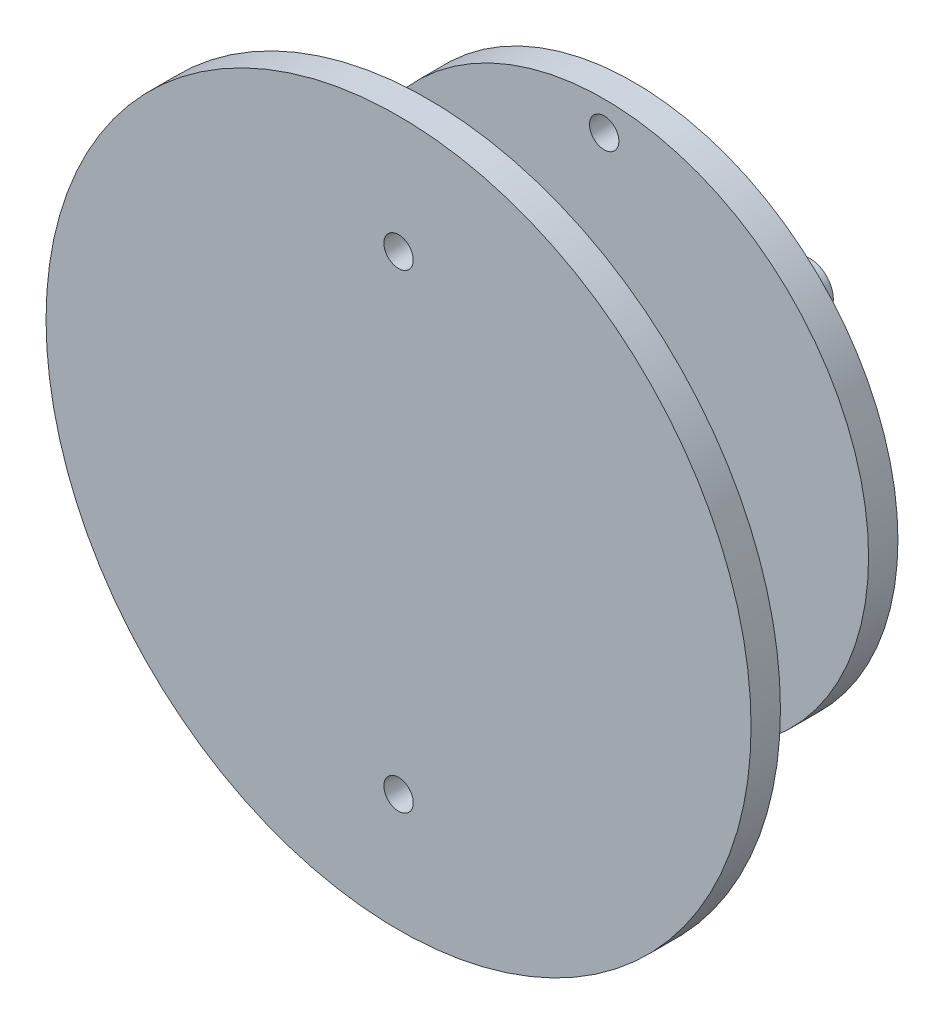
ISO-10303-21;
HEADER;
FILE_DESCRIPTION(('STEP AP214'),'2;1');
FILE_NAME('part.step','',(''),(''),'','','');
FILE_SCHEMA(('AUTOMOTIVE_DESIGN { 1 0 10303 214 1 1 1 1 }'));
ENDSEC;
DATA;
#1=APPLICATION_CONTEXT('core data for automotive mechanical design processes');
#2=APPLICATION_PROTOCOL_DEFINITION('international standard','automotive_design',2000,#1);
#3=PRODUCT_CONTEXT('',#1,'mechanical');
#4=PRODUCT('Part','Part','',(#3));
#5=PRODUCT_RELATED_PRODUCT_CATEGORY('part','',(#4));
#6=PRODUCT_DEFINITION_FORMATION('','',#4);
#7=PRODUCT_DEFINITION_CONTEXT('part definition',#1,'design');
#8=PRODUCT_DEFINITION('design','',#6,#7);
#9=PRODUCT_DEFINITION_SHAPE('','',#8);
#10=(LENGTH_UNIT() NAMED_UNIT(*) SI_UNIT(.MILLI.,.METRE.));
#11=(NAMED_UNIT(*) PLANE_ANGLE_UNIT() SI_UNIT($,.RADIAN.));
#12=(NAMED_UNIT(*) SI_UNIT($,.STERADIAN.) SOLID_ANGLE_UNIT());
#13=UNCERTAINTY_MEASURE_WITH_UNIT(LENGTH_MEASURE(1.E-05),#10,'distance_accuracy_value','');
#14=(GEOMETRIC_REPRESENTATION_CONTEXT(3) GLOBAL_UNCERTAINTY_ASSIGNED_CONTEXT((#13)) GLOBAL_UNIT_ASSIGNED_CONTEXT((#10,
#11,#12)) REPRESENTATION_CONTEXT('',''));
#15=CARTESIAN_POINT('',(0.,0.,0.));
#16=DIRECTION('',(0.,0.,1.));
#17=DIRECTION('',(1.,0.,0.));
#18=AXIS2_PLACEMENT_3D('',#15,#16,#17);
#19=CARTESIAN_POINT('',(0.,0.,70.));
#20=DIRECTION('',(0.,0.,-1.));
#21=DIRECTION('',(-1.,0.,0.));
#22=AXIS2_PLACEMENT_3D('',#19,#20,#21);
#23=CYLINDRICAL_SURFACE('',#22,4.);
#24=CARTESIAN_POINT('',(0.,0.,65.));
#25=DIRECTION('',(0.,0.,1.));
#26=DIRECTION('',(1.,0.,0.));
#27=AXIS2_PLACEMENT_3D('',#24,#25,#26);
#28=CIRCLE('',#27,4.);
#29=CARTESIAN_POINT('',(3.99999999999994,0.,65.));
#30=VERTEX_POINT('',#29);
#31=EDGE_CURVE('E40',#30,#30,#28,.T.);
#32=ORIENTED_EDGE('',*,*,#31,.F.);
#33=EDGE_LOOP('',(#32));
#34=FACE_BOUND('',#33,.T.);
#35=CARTESIAN_POINT('',(0.,0.,35.));
#36=DIRECTION('',(0.,0.,-1.));
#37=DIRECTION('',(-1.,0.,0.));
#38=AXIS2_PLACEMENT_3D('',#35,#36,#37);
#39=CIRCLE('',#38,4.);
#40=CARTESIAN_POINT('',(-4.00000000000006,0.,35.));
#41=VERTEX_POINT('',#40);
#42=EDGE_CURVE('E10',#41,#41,#39,.T.);
#43=ORIENTED_EDGE('',*,*,#42,.F.);
#44=EDGE_LOOP('',(#43));
#45=FACE_BOUND('',#44,.T.);
#46=ADVANCED_FACE('F33',(#34,#45),#23,.T.);
#47=CARTESIAN_POINT('',(0.,0.,65.));
#48=DIRECTION('',(0.,0.,1.));
#49=DIRECTION('',(1.,0.,0.));
#50=AXIS2_PLACEMENT_3D('',#47,#48,#49);
#51=CYLINDRICAL_SURFACE('',#50,60.);
#52=CARTESIAN_POINT('',(0.,0.,65.));
#53=DIRECTION('',(0.,0.,1.));
#54=DIRECTION('',(1.,0.,0.));
#55=AXIS2_PLACEMENT_3D('',#52,#53,#54);
#56=CIRCLE('',#55,60.);
#57=CARTESIAN_POINT('',(59.9999999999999,0.,65.));
#58=VERTEX_POINT('',#57);
#59=EDGE_CURVE('E49',#58,#58,#56,.T.);
#60=ORIENTED_EDGE('',*,*,#59,.T.);
#61=EDGE_LOOP('',(#60));
#62=FACE_BOUND('',#61,.T.);
#63=CARTESIAN_POINT('',(0.,0.,70.));
#64=DIRECTION('',(0.,0.,1.));
#65=DIRECTION('',(1.,0.,0.));
#66=AXIS2_PLACEMENT_3D('',#63,#64,#65);
#67=CIRCLE('',#66,60.);
#68=CARTESIAN_POINT('',(59.9999999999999,0.,70.));
#69=VERTEX_POINT('',#68);
#70=EDGE_CURVE('E54',#69,#69,#67,.T.);
#71=ORIENTED_EDGE('',*,*,#70,.F.);
#72=EDGE_LOOP('',(#71));
#73=FACE_BOUND('',#72,.T.);
#74=ADVANCED_FACE('F73',(#62,#73),#51,.T.);
#75=CARTESIAN_POINT('',(0.,0.,65.));
#76=DIRECTION('',(0.,0.,1.));
#77=DIRECTION('',(1.,0.,0.));
#78=AXIS2_PLACEMENT_3D('',#75,#76,#77);
#79=PLANE('',#78);
#80=CARTESIAN_POINT('',(0.,-40.,65.));
#81=DIRECTION('',(0.,0.,1.));
#82=DIRECTION('',(1.,0.,0.));
#83=AXIS2_PLACEMENT_3D('',#80,#81,#82);
#84=CIRCLE('',#83,2.5);
#85=CARTESIAN_POINT('',(2.5,-40.,65.));
#86=VERTEX_POINT('',#85);
#87=EDGE_CURVE('E186',#86,#86,#84,.F.);
#88=ORIENTED_EDGE('',*,*,#87,.F.);
#89=EDGE_LOOP('',(#88));
#90=FACE_BOUND('',#89,.T.);
#91=CARTESIAN_POINT('',(0.,40.,65.));
#92=DIRECTION('',(0.,0.,1.));
#93=DIRECTION('',(1.,0.,0.));
#94=AXIS2_PLACEMENT_3D('',#91,#92,#93);
#95=CIRCLE('',#94,2.5);
#96=CARTESIAN_POINT('',(2.5,40.,65.));
#97=VERTEX_POINT('',#96);
#98=EDGE_CURVE('E65',#97,#97,#95,.T.);
#99=ORIENTED_EDGE('',*,*,#98,.T.);
#100=EDGE_LOOP('',(#99));
#101=FACE_BOUND('',#100,.T.);
#102=ORIENTED_EDGE('',*,*,#31,.T.);
#103=EDGE_LOOP('',(#102));
#104=FACE_BOUND('',#103,.T.);
#105=ORIENTED_EDGE('',*,*,#59,.F.);
#106=EDGE_LOOP('',(#105));
#107=FACE_BOUND('',#106,.T.);
#108=ADVANCED_FACE('F76',(#90,#101,#104,#107),#79,.F.);
#109=CARTESIAN_POINT('',(0.,0.,70.));
#110=DIRECTION('',(0.,0.,1.));
#111=DIRECTION('',(1.,0.,0.));
#112=AXIS2_PLACEMENT_3D('',#109,#110,#111);
#113=PLANE('',#112);
#114=CARTESIAN_POINT('',(0.,-40.,70.));
#115=DIRECTION('',(0.,0.,1.));
#116=DIRECTION('',(1.,0.,0.));
#117=AXIS2_PLACEMENT_3D('',#114,#115,#116);
#118=CIRCLE('',#117,2.5);
#119=CARTESIAN_POINT('',(2.5,-40.,70.));
#120=VERTEX_POINT('',#119);
#121=EDGE_CURVE('E189',#120,#120,#118,.F.);
#122=ORIENTED_EDGE('',*,*,#121,.T.);
#123=EDGE_LOOP('',(#122));
#124=FACE_BOUND('',#123,.T.);
#125=CARTESIAN_POINT('',(0.,40.,70.));
#126=DIRECTION('',(0.,0.,1.));
#127=DIRECTION('',(1.,0.,0.));
#128=AXIS2_PLACEMENT_3D('',#125,#126,#127);
#129=CIRCLE('',#128,2.5);
#130=CARTESIAN_POINT('',(2.5,40.,70.));
#131=VERTEX_POINT('',#130);
#132=EDGE_CURVE('E176',#131,#131,#129,.T.);
#133=ORIENTED_EDGE('',*,*,#132,.F.);
#134=EDGE_LOOP('',(#133));
#135=FACE_BOUND('',#134,.T.);
#136=ORIENTED_EDGE('',*,*,#70,.T.);
#137=EDGE_LOOP('',(#136));
#138=FACE_BOUND('',#137,.T.);
#139=ADVANCED_FACE('F78',(#124,#135,#138),#113,.T.);
#140=CARTESIAN_POINT('',(0.,0.,35.));
#141=DIRECTION('',(0.,0.,-1.));
#142=DIRECTION('',(-1.,0.,0.));
#143=AXIS2_PLACEMENT_3D('',#140,#141,#142);
#144=CYLINDRICAL_SURFACE('',#143,45.);
#145=CARTESIAN_POINT('',(0.,0.,35.));
#146=DIRECTION('',(0.,0.,-1.));
#147=DIRECTION('',(-1.,0.,0.));
#148=AXIS2_PLACEMENT_3D('',#145,#146,#147);
#149=CIRCLE('',#148,45.);
#150=CARTESIAN_POINT('',(-45.,0.,35.));
#151=VERTEX_POINT('',#150);
#152=EDGE_CURVE('E55',#151,#151,#149,.T.);
#153=ORIENTED_EDGE('',*,*,#152,.T.);
#154=EDGE_LOOP('',(#153));
#155=FACE_BOUND('',#154,.T.);
#156=CARTESIAN_POINT('',(0.,0.,30.));
#157=DIRECTION('',(0.,0.,-1.));
#158=DIRECTION('',(-1.,0.,0.));
#159=AXIS2_PLACEMENT_3D('',#156,#157,#158);
#160=CIRCLE('',#159,45.);
#161=CARTESIAN_POINT('',(-45.,0.,30.));
#162=VERTEX_POINT('',#161);
#163=EDGE_CURVE('E60',#162,#162,#160,.T.);
#164=ORIENTED_EDGE('',*,*,#163,.F.);
#165=EDGE_LOOP('',(#164));
#166=FACE_BOUND('',#165,.T.);
#167=ADVANCED_FACE('F85',(#155,#166),#144,.T.);
#168=CARTESIAN_POINT('',(0.,0.,35.));
#169=DIRECTION('',(0.,0.,-1.));
#170=DIRECTION('',(-1.,0.,0.));
#171=AXIS2_PLACEMENT_3D('',#168,#169,#170);
#172=PLANE('',#171);
#173=CARTESIAN_POINT('',(0.,-40.,35.));
#174=DIRECTION('',(0.,0.,-1.));
#175=DIRECTION('',(-1.,0.,0.));
#176=AXIS2_PLACEMENT_3D('',#173,#174,#175);
#177=CIRCLE('',#176,2.5);
#178=CARTESIAN_POINT('',(-2.5,-40.,35.));
#179=VERTEX_POINT('',#178);
#180=EDGE_CURVE('E192',#179,#179,#177,.F.);
#181=ORIENTED_EDGE('',*,*,#180,.F.);
#182=EDGE_LOOP('',(#181));
#183=FACE_BOUND('',#182,.T.);
#184=CARTESIAN_POINT('',(0.,40.,35.));
#185=DIRECTION('',(0.,0.,-1.));
#186=DIRECTION('',(-1.,0.,0.));
#187=AXIS2_PLACEMENT_3D('',#184,#185,#186);
#188=CIRCLE('',#187,2.5);
#189=CARTESIAN_POINT('',(-2.5,40.,35.));
#190=VERTEX_POINT('',#189);
#191=EDGE_CURVE('E179',#190,#190,#188,.T.);
#192=ORIENTED_EDGE('',*,*,#191,.T.);
#193=EDGE_LOOP('',(#192));
#194=FACE_BOUND('',#193,.T.);
#195=ORIENTED_EDGE('',*,*,#42,.T.);
#196=EDGE_LOOP('',(#195));
#197=FACE_BOUND('',#196,.T.);
#198=ORIENTED_EDGE('',*,*,#152,.F.);
#199=EDGE_LOOP('',(#198));
#200=FACE_BOUND('',#199,.T.);
#201=ADVANCED_FACE('F114',(#183,#194,#197,#200),#172,.F.);
#202=CARTESIAN_POINT('',(0.,0.,30.));
#203=DIRECTION('',(0.,0.,-1.));
#204=DIRECTION('',(-1.,0.,0.));
#205=AXIS2_PLACEMENT_3D('',#202,#203,#204);
#206=PLANE('',#205);
#207=CARTESIAN_POINT('',(0.,-40.,30.));
#208=DIRECTION('',(0.,0.,1.));
#209=DIRECTION('',(-1.,0.,0.));
#210=AXIS2_PLACEMENT_3D('',#207,#208,#209);
#211=CIRCLE('',#210,2.5);
#212=CARTESIAN_POINT('',(-2.5,-40.,30.));
#213=VERTEX_POINT('',#212);
#214=EDGE_CURVE('E195',#213,#213,#211,.T.);
#215=ORIENTED_EDGE('',*,*,#214,.T.);
#216=EDGE_LOOP('',(#215));
#217=FACE_BOUND('',#216,.T.);
#218=CARTESIAN_POINT('',(0.,40.,30.));
#219=DIRECTION('',(0.,0.,-1.));
#220=DIRECTION('',(-1.,0.,0.));
#221=AXIS2_PLACEMENT_3D('',#218,#219,#220);
#222=CIRCLE('',#221,2.5);
#223=CARTESIAN_POINT('',(-2.5,40.,30.));
#224=VERTEX_POINT('',#223);
#225=EDGE_CURVE('E181',#224,#224,#222,.T.);
#226=ORIENTED_EDGE('',*,*,#225,.F.);
#227=EDGE_LOOP('',(#226));
#228=FACE_BOUND('',#227,.T.);
#229=CARTESIAN_POINT('',(0.,0.,30.));
#230=DIRECTION('',(0.,0.,-1.));
#231=DIRECTION('',(-1.,0.,0.));
#232=AXIS2_PLACEMENT_3D('',#229,#230,#231);
#233=CIRCLE('',#232,4.);
#234=CARTESIAN_POINT('',(-4.00000000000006,0.,30.));
#235=VERTEX_POINT('',#234);
#236=EDGE_CURVE('E52',#235,#235,#233,.T.);
#237=ORIENTED_EDGE('',*,*,#236,.F.);
#238=EDGE_LOOP('',(#237));
#239=FACE_BOUND('',#238,.T.);
#240=ORIENTED_EDGE('',*,*,#163,.T.);
#241=EDGE_LOOP('',(#240));
#242=FACE_BOUND('',#241,.T.);
#243=ADVANCED_FACE('F107',(#217,#228,#239,#242),#206,.T.);
#244=CARTESIAN_POINT('',(0.,0.,0.));
#245=DIRECTION('',(0.,0.,1.));
#246=DIRECTION('',(1.,0.,0.));
#247=AXIS2_PLACEMENT_3D('',#244,#245,#246);
#248=PLANE('',#247);
#249=CARTESIAN_POINT('',(0.,0.,0.));
#250=DIRECTION('',(0.,0.,1.));
#251=DIRECTION('',(1.,0.,0.));
#252=AXIS2_PLACEMENT_3D('',#249,#250,#251);
#253=CIRCLE('',#252,4.);
#254=CARTESIAN_POINT('',(3.99999999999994,0.,0.));
#255=VERTEX_POINT('',#254);
#256=EDGE_CURVE('E44',#255,#255,#253,.T.);
#257=ORIENTED_EDGE('',*,*,#256,.F.);
#258=EDGE_LOOP('',(#257));
#259=FACE_BOUND('',#258,.T.);
#260=ADVANCED_FACE('F99',(#259),#248,.F.);
#261=ORIENTED_EDGE('',*,*,#236,.T.);
#262=EDGE_LOOP('',(#261));
#263=FACE_BOUND('',#262,.T.);
#264=ORIENTED_EDGE('',*,*,#256,.T.);
#265=EDGE_LOOP('',(#264));
#266=FACE_BOUND('',#265,.T.);
#267=ADVANCED_FACE('F35',(#263,#266),#23,.T.);
#268=CARTESIAN_POINT('',(0.,40.,130.));
#269=DIRECTION('',(0.,0.,-1.));
#270=DIRECTION('',(-1.,0.,0.));
#271=AXIS2_PLACEMENT_3D('',#268,#269,#270);
#272=CYLINDRICAL_SURFACE('',#271,2.5);
#273=ORIENTED_EDGE('',*,*,#225,.T.);
#274=EDGE_LOOP('',(#273));
#275=FACE_BOUND('',#274,.T.);
#276=ORIENTED_EDGE('',*,*,#191,.F.);
#277=EDGE_LOOP('',(#276));
#278=FACE_BOUND('',#277,.T.);
#279=ADVANCED_FACE('F98',(#275,#278),#272,.F.);
#280=ORIENTED_EDGE('',*,*,#132,.T.);
#281=EDGE_LOOP('',(#280));
#282=FACE_BOUND('',#281,.T.);
#283=ORIENTED_EDGE('',*,*,#98,.F.);
#284=EDGE_LOOP('',(#283));
#285=FACE_BOUND('',#284,.T.);
#286=ADVANCED_FACE('F104',(#282,#285),#272,.F.);
#287=CARTESIAN_POINT('',(0.,-40.,130.));
#288=DIRECTION('',(0.,0.,-1.));
#289=DIRECTION('',(-1.,0.,0.));
#290=AXIS2_PLACEMENT_3D('',#287,#288,#289);
#291=CYLINDRICAL_SURFACE('',#290,2.5);
#292=ORIENTED_EDGE('',*,*,#214,.F.);
#293=EDGE_LOOP('',(#292));
#294=FACE_BOUND('',#293,.T.);
#295=ORIENTED_EDGE('',*,*,#180,.T.);
#296=EDGE_LOOP('',(#295));
#297=FACE_BOUND('',#296,.T.);
#298=ADVANCED_FACE('F148',(#294,#297),#291,.F.);
#299=ORIENTED_EDGE('',*,*,#121,.F.);
#300=EDGE_LOOP('',(#299));
#301=FACE_BOUND('',#300,.T.);
#302=ORIENTED_EDGE('',*,*,#87,.T.);
#303=EDGE_LOOP('',(#302));
#304=FACE_BOUND('',#303,.T.);
#305=ADVANCED_FACE('F153',(#301,#304),#291,.F.);
#306=CLOSED_SHELL('',(#46,#74,#108,#139,#167,#201,#243,#260,#267,#279,#286,#298,#305));
#307=MANIFOLD_SOLID_BREP('B2',#306);
#308=ADVANCED_BREP_SHAPE_REPRESENTATION('',(#18,#307),#14);
#309=SHAPE_DEFINITION_REPRESENTATION(#9,#308);
ENDSEC;
END-ISO-10303-21;
